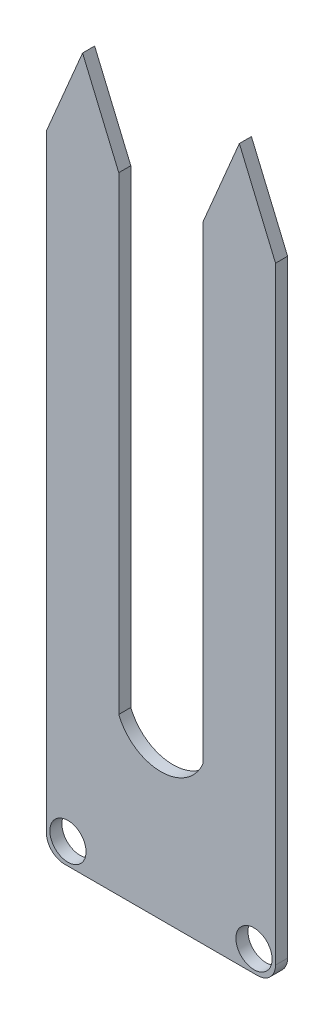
from build123d import *

# Parameters (mm, degrees)
SKETCH1_R           = 1.5005731
BOSS_EXTRUDE1_DEPTH = 1


with BuildPart() as part:
    # Sketch1 → Boss-Extrude1 (new body)
    with BuildSketch(Plane.XY):
        with BuildLine():
            Line((-7.439393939, 26.196969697), (-10.439393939, 19.101257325))
            Line((-10.439393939, 19.101257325), (-10.439393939, -19.803030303))
            Line((-10.439393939, -19.803030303), (-10.439393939, -31.303030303))
            ThreePointArc((-10.439393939, -31.303030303), (-10.000054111, -32.363690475), (-8.939393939, -32.803030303))
            Line((-8.939393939, -32.803030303), (7.060606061, -32.803030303))
            ThreePointArc((7.060606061, -32.803030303), (8.121266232, -32.363690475), (8.560606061, -31.303030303))
            Line((8.560606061, -31.303030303), (8.560606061, -19.803030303))
            Line((8.560606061, -19.803030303), (8.560606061, 19.101257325))
            Line((8.560606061, 19.101257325), (5.560606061, 26.196969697))
            Line((5.560606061, 26.196969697), (2.560606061, 19.101257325))
            Line((2.560606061, 19.101257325), (2.560606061, -19.803030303))
            ThreePointArc((2.560606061, -19.803030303), (-0.939393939, -22.171136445), (-4.439393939, -19.803030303))
            Line((-4.439393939, -19.803030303), (-4.439393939, 19.101257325))
            Line((-4.439393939, 19.101257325), (-7.439393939, 26.196969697))
        make_face()
        with Locations((-8.652229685, -31.022639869)):
            Circle(SKETCH1_R, mode=Mode.SUBTRACT)
        with Locations(Location((6.773441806, -31.022639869, 0), (0, 0, 180))):
            Circle(SKETCH1_R, mode=Mode.SUBTRACT)
    extrude(amount=BOSS_EXTRUDE1_DEPTH)


solid = part.part
